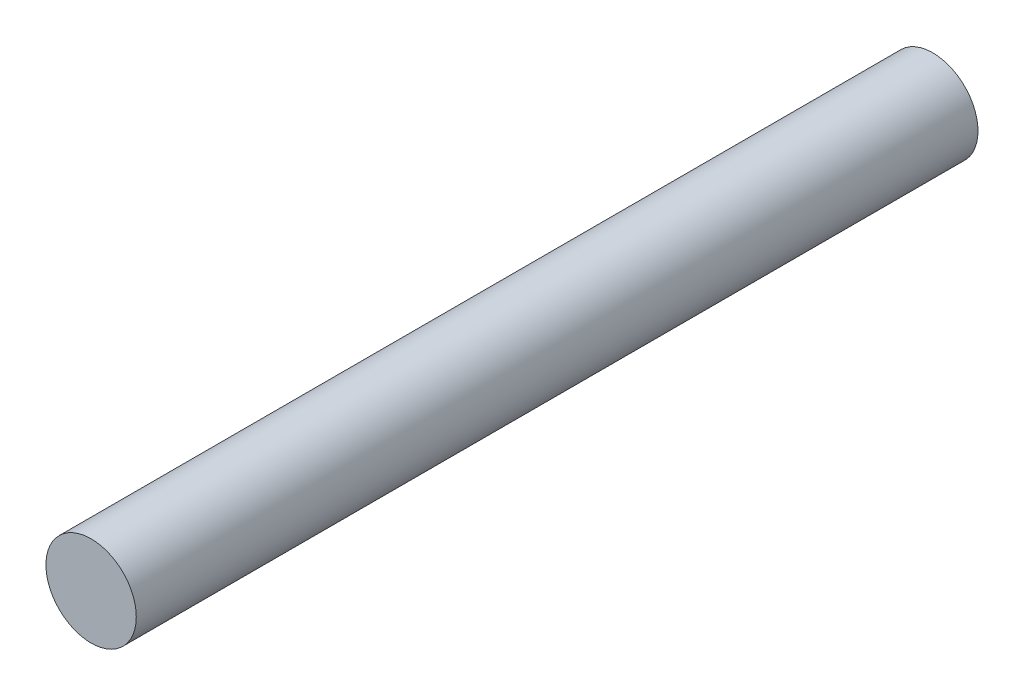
from build123d import *

# Parameters (mm, degrees)
SKETCH1_R           = 0.6477
BOSS_EXTRUDE1_DEPTH = 12.065


with BuildPart() as part:
    # Sketch1 → Boss-Extrude1 (new body)
    with BuildSketch(Plane.XY):
        Circle(SKETCH1_R)
    extrude(amount=BOSS_EXTRUDE1_DEPTH)


solid = part.part
